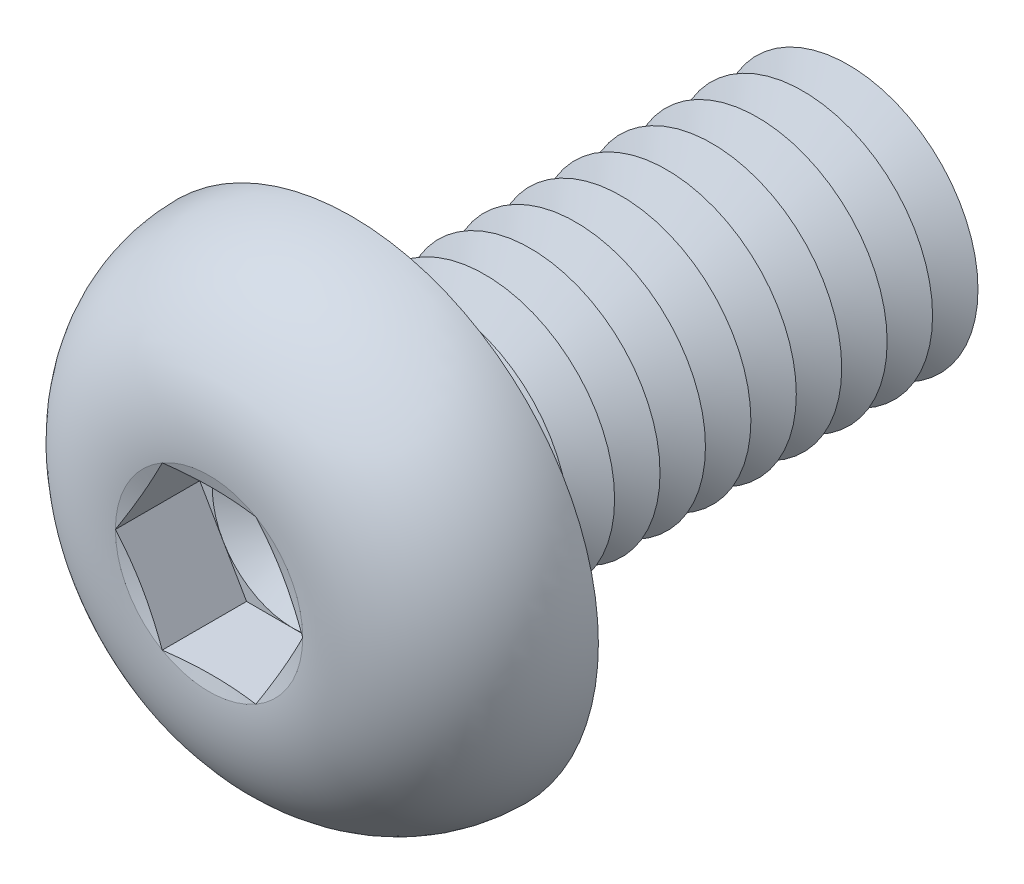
from build123d import *

# Parameters (mm, degrees)
FILLET1_R          = 0.35
LPATTERN1_COUNT    = 11
LPATTERN1_PITCH    = 0.7
CUT_EXTRUDE1_DEPTH = 1.3


with BuildPart() as part:
    # Sketch1 → Revolve1 (revolve)
    with BuildSketch(Plane(origin=(0, 0, 0), x_dir=(0, 0, -1), z_dir=(1, 0, 0)), mode=Mode.PRIVATE) as revolve1_sk:
        with BuildLine():
            Line((0, 2), (0, 3.8))
            ThreePointArc((0, 3.8), (-1.611961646, 3.099623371), (-2.2, 1.443375))
            Line((-2.2, 1.443375), (-2.006624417, 0.7216875))
            Line((-2.006624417, 0.7216875), (-2.2, 0.7216875))
            Line((-2.2, 0.7216875), (-2.2, 0))
            Line((-2.2, 0), (8, 0))
            Line((8, 0), (8, 2))
            Line((8, 2), (0, 2))
        make_face()
    revolve(revolve1_sk.sketch.rotate(Axis((0, 0, -8), (0, 0, 1)), 90), axis=Axis((0, 0, -8), (0, 0, 1)))

    # Fillet1
    fillet1_edges = [part.edges().sort_by_distance(p)[0] for p in [
        (2, 0, 0),
    ]]
    fillet(fillet1_edges, radius=FILLET1_R)

    # Sketch2 → Cut-Revolve1 (revolve, cut)
    with BuildSketch(Plane(origin=(0, 0, 0), x_dir=(0, 0, -1), z_dir=(1, 0, 0)), mode=Mode.PRIVATE) as cut_revolve1_sk:
        Polygon((7.65, 2), (8.35, 2), (8, 1.393782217), align=None)
    cut_revolve1 = revolve(cut_revolve1_sk.sketch.rotate(Axis((0, 0, -8), (0, 0, -1)), 270), axis=Axis((0, 0, -8), (0, 0, -1)), mode=Mode.SUBTRACT)

    # LPattern1: Cut-Revolve1 ×11
    with Locations(*[(0, 0, i * LPATTERN1_PITCH) for i in range(1, LPATTERN1_COUNT)]):
        add(cut_revolve1, mode=Mode.SUBTRACT)

    # Sketch3 → Cut-Extrude1 (cut)
    with BuildSketch(Plane.XY.offset(2.2)):
        Polygon((0.7216875, 1.249999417), (-0.7216875, 1.249999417), (-1.443375, 0), (-0.7216875, -1.249999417), (0.7216875, -1.249999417), (1.443375, 0), align=None)
    extrude(amount=-CUT_EXTRUDE1_DEPTH, mode=Mode.SUBTRACT)

    # Cut-Extrude2 cone 1 section (on through the dimple's axis) → Cut-Extrude2 (revolve, cut)
    with BuildSketch(Plane(origin=(0, 0, 0.9), x_dir=(0, -1, 0), z_dir=(1, 0, 0))):
        Polygon((0, 0), (1.249999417, 0), (0, 0.7216875), align=None)
    revolve(axis=Axis((0, 0, 0.9), (0, 0, -1)), mode=Mode.SUBTRACT)


solid = part.part
